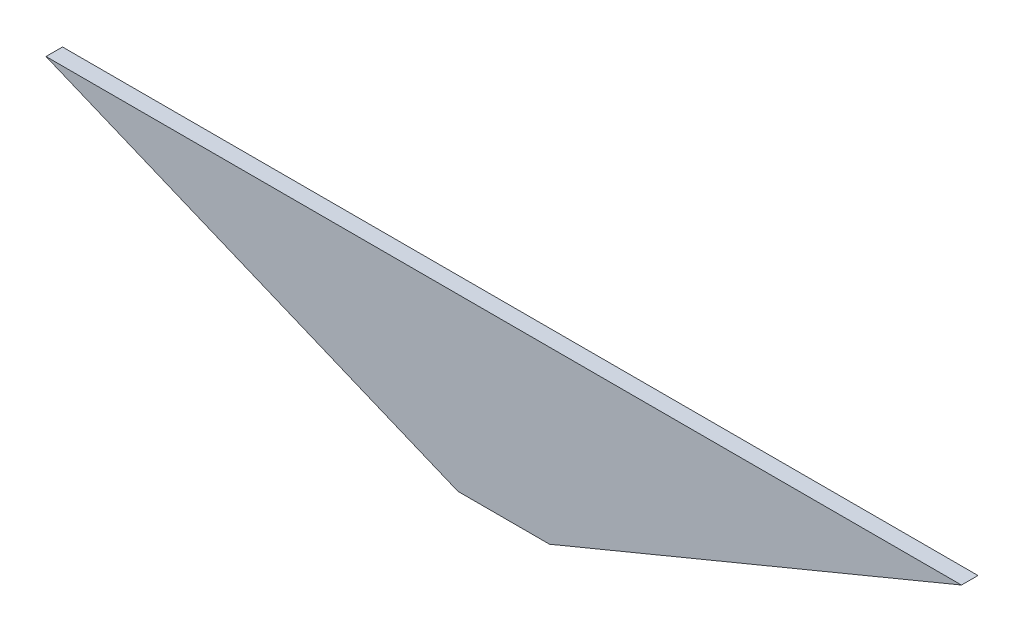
ISO-10303-21;
HEADER;
FILE_DESCRIPTION(('STEP AP214'),'2;1');
FILE_NAME('part.step','',(''),(''),'','','');
FILE_SCHEMA(('AUTOMOTIVE_DESIGN { 1 0 10303 214 1 1 1 1 }'));
ENDSEC;
DATA;
#1=APPLICATION_CONTEXT('core data for automotive mechanical design processes');
#2=APPLICATION_PROTOCOL_DEFINITION('international standard','automotive_design',2000,#1);
#3=PRODUCT_CONTEXT('',#1,'mechanical');
#4=PRODUCT('Part','Part','',(#3));
#5=PRODUCT_RELATED_PRODUCT_CATEGORY('part','',(#4));
#6=PRODUCT_DEFINITION_FORMATION('','',#4);
#7=PRODUCT_DEFINITION_CONTEXT('part definition',#1,'design');
#8=PRODUCT_DEFINITION('design','',#6,#7);
#9=PRODUCT_DEFINITION_SHAPE('','',#8);
#10=(LENGTH_UNIT() NAMED_UNIT(*) SI_UNIT(.MILLI.,.METRE.));
#11=(NAMED_UNIT(*) PLANE_ANGLE_UNIT() SI_UNIT($,.RADIAN.));
#12=(NAMED_UNIT(*) SI_UNIT($,.STERADIAN.) SOLID_ANGLE_UNIT());
#13=UNCERTAINTY_MEASURE_WITH_UNIT(LENGTH_MEASURE(1.E-05),#10,'distance_accuracy_value','');
#14=(GEOMETRIC_REPRESENTATION_CONTEXT(3) GLOBAL_UNCERTAINTY_ASSIGNED_CONTEXT((#13)) GLOBAL_UNIT_ASSIGNED_CONTEXT((#10,
#11,#12)) REPRESENTATION_CONTEXT('',''));
#15=CARTESIAN_POINT('',(0.,0.,0.));
#16=DIRECTION('',(0.,0.,1.));
#17=DIRECTION('',(1.,0.,0.));
#18=AXIS2_PLACEMENT_3D('',#15,#16,#17);
#19=CARTESIAN_POINT('',(-13.858,0.,2.5));
#20=DIRECTION('',(0.38268107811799,0.923880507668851,0.));
#21=DIRECTION('',(-0.923880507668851,0.38268107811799,0.));
#22=AXIS2_PLACEMENT_3D('',#19,#20,#21);
#23=PLANE('',#22);
#24=DIRECTION('',(0.923880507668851,-0.38268107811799,0.));
#25=VECTOR('',#24,1.);
#26=CARTESIAN_POINT('',(-13.858,0.,-2.5));
#27=LINE('',#26,#25);
#28=CARTESIAN_POINT('',(-138.582,51.662,-2.5));
#29=VERTEX_POINT('',#28);
#30=CARTESIAN_POINT('',(-13.858,0.,-2.5));
#31=VERTEX_POINT('',#30);
#32=EDGE_CURVE('E97',#29,#31,#27,.T.);
#33=ORIENTED_EDGE('',*,*,#32,.T.);
#34=DIRECTION('',(0.,0.,-1.));
#35=VECTOR('',#34,1.);
#36=CARTESIAN_POINT('',(-13.858,0.,2.5));
#37=LINE('',#36,#35);
#38=CARTESIAN_POINT('',(-13.858,0.,2.5));
#39=VERTEX_POINT('',#38);
#40=EDGE_CURVE('E11',#39,#31,#37,.T.);
#41=ORIENTED_EDGE('',*,*,#40,.F.);
#42=DIRECTION('',(0.923880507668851,-0.38268107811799,0.));
#43=VECTOR('',#42,1.);
#44=CARTESIAN_POINT('',(-13.858,0.,2.5));
#45=LINE('',#44,#43);
#46=CARTESIAN_POINT('',(-138.582,51.662,2.5));
#47=VERTEX_POINT('',#46);
#48=EDGE_CURVE('E85',#47,#39,#45,.T.);
#49=ORIENTED_EDGE('',*,*,#48,.F.);
#50=DIRECTION('',(0.,0.,-1.));
#51=VECTOR('',#50,1.);
#52=CARTESIAN_POINT('',(-138.582,51.662,2.5));
#53=LINE('',#52,#51);
#54=EDGE_CURVE('E93',#47,#29,#53,.T.);
#55=ORIENTED_EDGE('',*,*,#54,.T.);
#56=EDGE_LOOP('',(#33,#41,#49,#55));
#57=FACE_BOUND('',#56,.T.);
#58=ADVANCED_FACE('F34',(#57),#23,.F.);
#59=CARTESIAN_POINT('',(-13.858,0.,2.5));
#60=DIRECTION('',(0.,1.,0.));
#61=DIRECTION('',(0.,0.,1.));
#62=AXIS2_PLACEMENT_3D('',#59,#60,#61);
#63=PLANE('',#62);
#64=DIRECTION('',(1.,0.,0.));
#65=VECTOR('',#64,1.);
#66=CARTESIAN_POINT('',(-13.858,0.,-2.5));
#67=LINE('',#66,#65);
#68=CARTESIAN_POINT('',(13.858,0.,-2.5));
#69=VERTEX_POINT('',#68);
#70=EDGE_CURVE('E89',#31,#69,#67,.T.);
#71=ORIENTED_EDGE('',*,*,#70,.T.);
#72=DIRECTION('',(0.,0.,-1.));
#73=VECTOR('',#72,1.);
#74=CARTESIAN_POINT('',(13.858,0.,2.5));
#75=LINE('',#74,#73);
#76=CARTESIAN_POINT('',(13.858,0.,2.5));
#77=VERTEX_POINT('',#76);
#78=EDGE_CURVE('E42',#77,#69,#75,.T.);
#79=ORIENTED_EDGE('',*,*,#78,.F.);
#80=DIRECTION('',(1.,0.,0.));
#81=VECTOR('',#80,1.);
#82=CARTESIAN_POINT('',(-13.858,0.,2.5));
#83=LINE('',#82,#81);
#84=EDGE_CURVE('E80',#39,#77,#83,.T.);
#85=ORIENTED_EDGE('',*,*,#84,.F.);
#86=ORIENTED_EDGE('',*,*,#40,.T.);
#87=EDGE_LOOP('',(#71,#79,#85,#86));
#88=FACE_BOUND('',#87,.T.);
#89=ADVANCED_FACE('F88',(#88),#63,.F.);
#90=CARTESIAN_POINT('',(13.858,0.,2.5));
#91=DIRECTION('',(-0.38268107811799,0.923880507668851,0.));
#92=DIRECTION('',(-0.923880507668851,-0.38268107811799,0.));
#93=AXIS2_PLACEMENT_3D('',#90,#91,#92);
#94=PLANE('',#93);
#95=DIRECTION('',(0.923880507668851,0.38268107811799,0.));
#96=VECTOR('',#95,1.);
#97=CARTESIAN_POINT('',(13.858,0.,-2.5));
#98=LINE('',#97,#96);
#99=CARTESIAN_POINT('',(138.582,51.662,-2.5));
#100=VERTEX_POINT('',#99);
#101=EDGE_CURVE('E67',#69,#100,#98,.T.);
#102=ORIENTED_EDGE('',*,*,#101,.T.);
#103=DIRECTION('',(0.,0.,-1.));
#104=VECTOR('',#103,1.);
#105=CARTESIAN_POINT('',(138.582,51.662,2.5));
#106=LINE('',#105,#104);
#107=CARTESIAN_POINT('',(138.582,51.662,2.5));
#108=VERTEX_POINT('',#107);
#109=EDGE_CURVE('E90',#108,#100,#106,.T.);
#110=ORIENTED_EDGE('',*,*,#109,.F.);
#111=DIRECTION('',(0.923880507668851,0.38268107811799,0.));
#112=VECTOR('',#111,1.);
#113=CARTESIAN_POINT('',(13.858,0.,2.5));
#114=LINE('',#113,#112);
#115=EDGE_CURVE('E83',#77,#108,#114,.T.);
#116=ORIENTED_EDGE('',*,*,#115,.F.);
#117=ORIENTED_EDGE('',*,*,#78,.T.);
#118=EDGE_LOOP('',(#102,#110,#116,#117));
#119=FACE_BOUND('',#118,.T.);
#120=ADVANCED_FACE('F91',(#119),#94,.F.);
#121=CARTESIAN_POINT('',(-138.582,51.662,2.5));
#122=DIRECTION('',(0.,-1.,0.));
#123=DIRECTION('',(0.,0.,-1.));
#124=AXIS2_PLACEMENT_3D('',#121,#122,#123);
#125=PLANE('',#124);
#126=DIRECTION('',(-1.,0.,0.));
#127=VECTOR('',#126,1.);
#128=CARTESIAN_POINT('',(-138.582,51.662,-2.5));
#129=LINE('',#128,#127);
#130=EDGE_CURVE('E73',#100,#29,#129,.T.);
#131=ORIENTED_EDGE('',*,*,#130,.T.);
#132=ORIENTED_EDGE('',*,*,#54,.F.);
#133=DIRECTION('',(-1.,0.,0.));
#134=VECTOR('',#133,1.);
#135=CARTESIAN_POINT('',(-138.582,51.662,2.5));
#136=LINE('',#135,#134);
#137=EDGE_CURVE('E50',#108,#47,#136,.T.);
#138=ORIENTED_EDGE('',*,*,#137,.F.);
#139=ORIENTED_EDGE('',*,*,#109,.T.);
#140=EDGE_LOOP('',(#131,#132,#138,#139));
#141=FACE_BOUND('',#140,.T.);
#142=ADVANCED_FACE('F104',(#141),#125,.F.);
#143=CARTESIAN_POINT('',(0.,0.,2.5));
#144=DIRECTION('',(0.,0.,-1.));
#145=DIRECTION('',(-1.,0.,0.));
#146=AXIS2_PLACEMENT_3D('',#143,#144,#145);
#147=PLANE('',#146);
#148=ORIENTED_EDGE('',*,*,#48,.T.);
#149=ORIENTED_EDGE('',*,*,#84,.T.);
#150=ORIENTED_EDGE('',*,*,#115,.T.);
#151=ORIENTED_EDGE('',*,*,#137,.T.);
#152=EDGE_LOOP('',(#148,#149,#150,#151));
#153=FACE_BOUND('',#152,.T.);
#154=ADVANCED_FACE('F81',(#153),#147,.F.);
#155=CARTESIAN_POINT('',(0.,0.,-2.5));
#156=DIRECTION('',(0.,0.,-1.));
#157=DIRECTION('',(-1.,0.,0.));
#158=AXIS2_PLACEMENT_3D('',#155,#156,#157);
#159=PLANE('',#158);
#160=ORIENTED_EDGE('',*,*,#32,.F.);
#161=ORIENTED_EDGE('',*,*,#130,.F.);
#162=ORIENTED_EDGE('',*,*,#101,.F.);
#163=ORIENTED_EDGE('',*,*,#70,.F.);
#164=EDGE_LOOP('',(#160,#161,#162,#163));
#165=FACE_BOUND('',#164,.T.);
#166=ADVANCED_FACE('F107',(#165),#159,.T.);
#167=CLOSED_SHELL('',(#58,#89,#120,#142,#154,#166));
#168=MANIFOLD_SOLID_BREP('B2',#167);
#169=ADVANCED_BREP_SHAPE_REPRESENTATION('',(#18,#168),#14);
#170=SHAPE_DEFINITION_REPRESENTATION(#9,#169);
ENDSEC;
END-ISO-10303-21;
